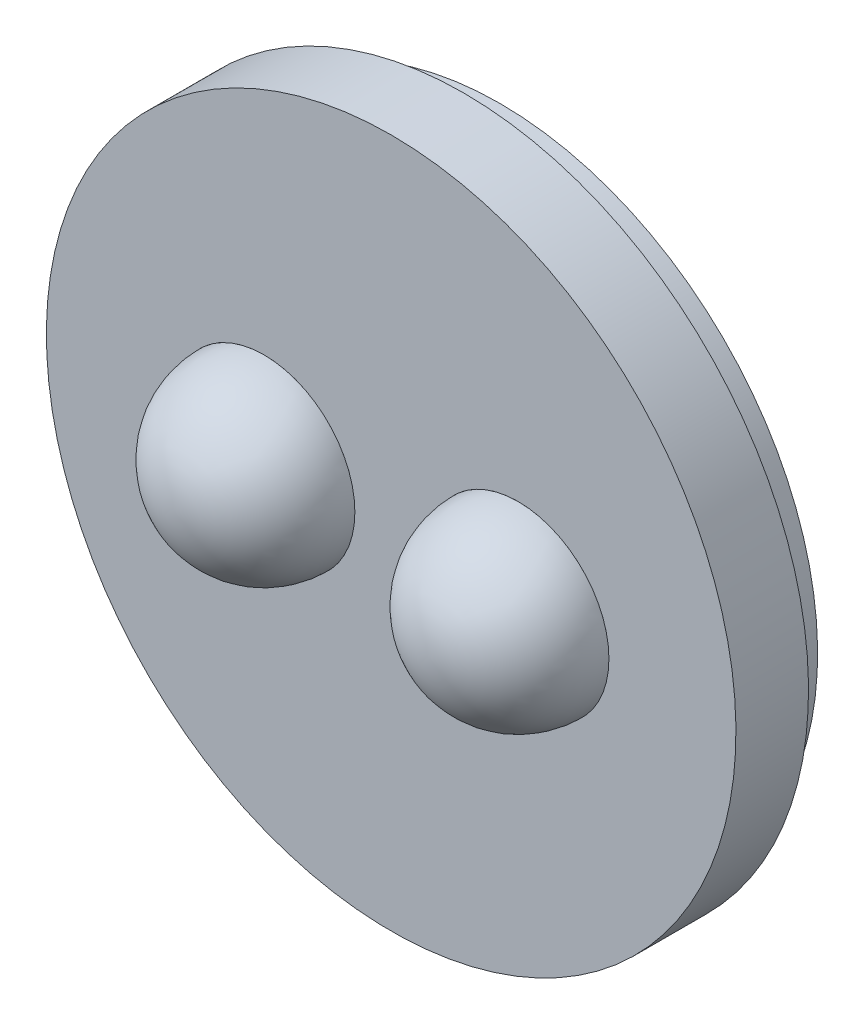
from build123d import *

# Parameters (mm, degrees)
SKETCH2_R          = 31.75
CUT_EXTRUDE1_DEPTH = 175.826928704


with BuildPart() as part:
    # Sketch1 → Revolve1 (revolve)
    with BuildSketch(Plane(origin=(0, 0, 0), x_dir=(0, 0, -1), z_dir=(1, 0, 0))):
        Polygon((0, 0), (0, 120.65), (25.4, 120.65), (25.4, 111.125), (38.1, 111.125), (38.1, 0), align=None)
    revolve(axis=Axis((0, 0, -38.1), (0, 0, 1)))

    # Sketch2 → Cut-Extrude1 (cut, through all)
    with BuildSketch(Plane.XY):
        with Locations((44.45, 0)):
            Circle(SKETCH2_R)
        with Locations((-44.45, 0)):
            Circle(SKETCH2_R)
    extrude(amount=-CUT_EXTRUDE1_DEPTH, mode=Mode.SUBTRACT)


with BuildPart() as body_2:
    # Sketch5 → Revolve2 (revolve)
    with BuildSketch(Plane(origin=(-44.45, 0, 0), x_dir=(0, 0, -1), z_dir=(1, 0, 0))):
        with BuildLine():
            Line((0, 0), (-31.75, 0))
            ThreePointArc((-31.75, 0), (-22.450640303, -22.450640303), (0, -31.75))
            Line((0, -31.75), (0, 0))
        make_face()
    revolve(axis=Axis((-44.45, 0, 0), (0, 0, 1)))


with BuildPart() as body_3:
    # Sketch6 → Revolve3 (revolve)
    with BuildSketch(Plane(origin=(44.45, 0, 0), x_dir=(0, 0, -1), z_dir=(1, 0, 0))):
        with BuildLine():
            Line((0, 0), (0, -31.75))
            ThreePointArc((0, -31.75), (-22.450640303, -22.450640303), (-31.75, 0))
            Line((-31.75, 0), (0, 0))
        make_face()
    revolve(axis=Axis((44.45, 0, 0), (0, 0, 1)))


solid = Compound([part.part, body_2.part, body_3.part])
